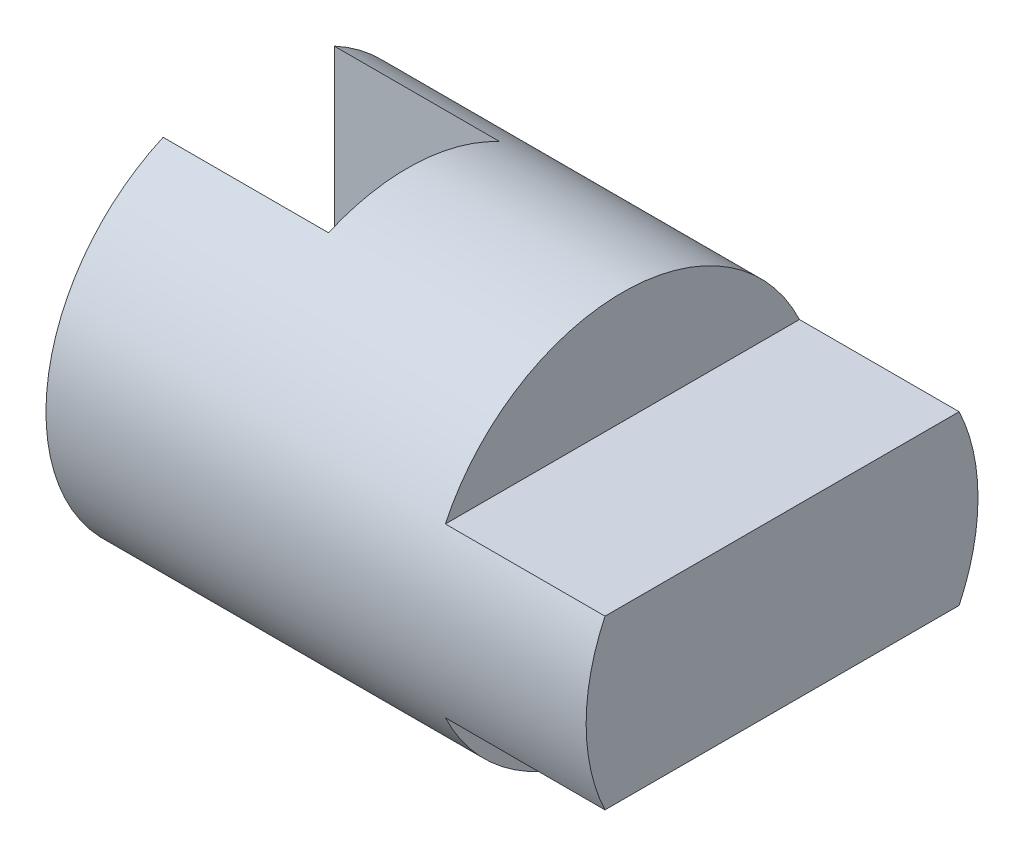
from build123d import *

# Parameters (mm, degrees)
SKETCH_1_W               = 102.752957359
SKETCH_1_H               = 37.270220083
CUT_EXTRUDE_1_DEPTH      = 77.536037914
CUT_EXTRUDE_1_DEPTH_BACK = 77.536037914
SKETCH_2_W               = 30.372179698
SKETCH_2_H               = 21.311304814
CUT_EXTRUDE_2_DEPTH      = 77.536037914
CUT_EXTRUDE_2_DEPTH_BACK = 77.536037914
SKETCH_3_W               = 31.462053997
SKETCH_3_H               = 32.563652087


with BuildPart() as part:
    # Sketch 1 → Revolve 1 (revolve)
    with BuildSketch(Plane.XY, mode=Mode.PRIVATE) as revolve_1_sk:
        with Locations((-4.117903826, 18.635110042)):
            Rectangle(SKETCH_1_W, SKETCH_1_H)
    revolve(revolve_1_sk.sketch.rotate(Axis((-80.440187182, 0, 0), (1, 0, 0)), 90), axis=Axis((-80.440187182, 0, 0), (1, 0, 0)))

    # Sketch 2 → Cut-Extrude 1 (cut, two sides: drawn at the far end of the back side and taken through both)
    with BuildSketch(Plane.XY.offset(-CUT_EXTRUDE_1_DEPTH_BACK)):
        with Locations((32.072485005, 26.614567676)):
            Rectangle(SKETCH_2_W, SKETCH_2_H)
        with Locations((32.072485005, -26.614567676)):
            Rectangle(SKETCH_2_W, SKETCH_2_H)
    extrude(amount=CUT_EXTRUDE_1_DEPTH + CUT_EXTRUDE_1_DEPTH_BACK, mode=Mode.SUBTRACT)

    # Sketch 3 → Cut-Extrude 2 (cut, two sides: drawn at the far end of the back side and taken through both)
    with BuildSketch(Plane(origin=(0, 0, 0), x_dir=(1, 0, 0), z_dir=(0, 1, 0)).offset(-CUT_EXTRUDE_2_DEPTH_BACK)):
        with Locations((-39.763355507, 1.297356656)):
            Rectangle(SKETCH_3_W, SKETCH_3_H)
    extrude(amount=CUT_EXTRUDE_2_DEPTH + CUT_EXTRUDE_2_DEPTH_BACK, mode=Mode.SUBTRACT)


solid = part.part
